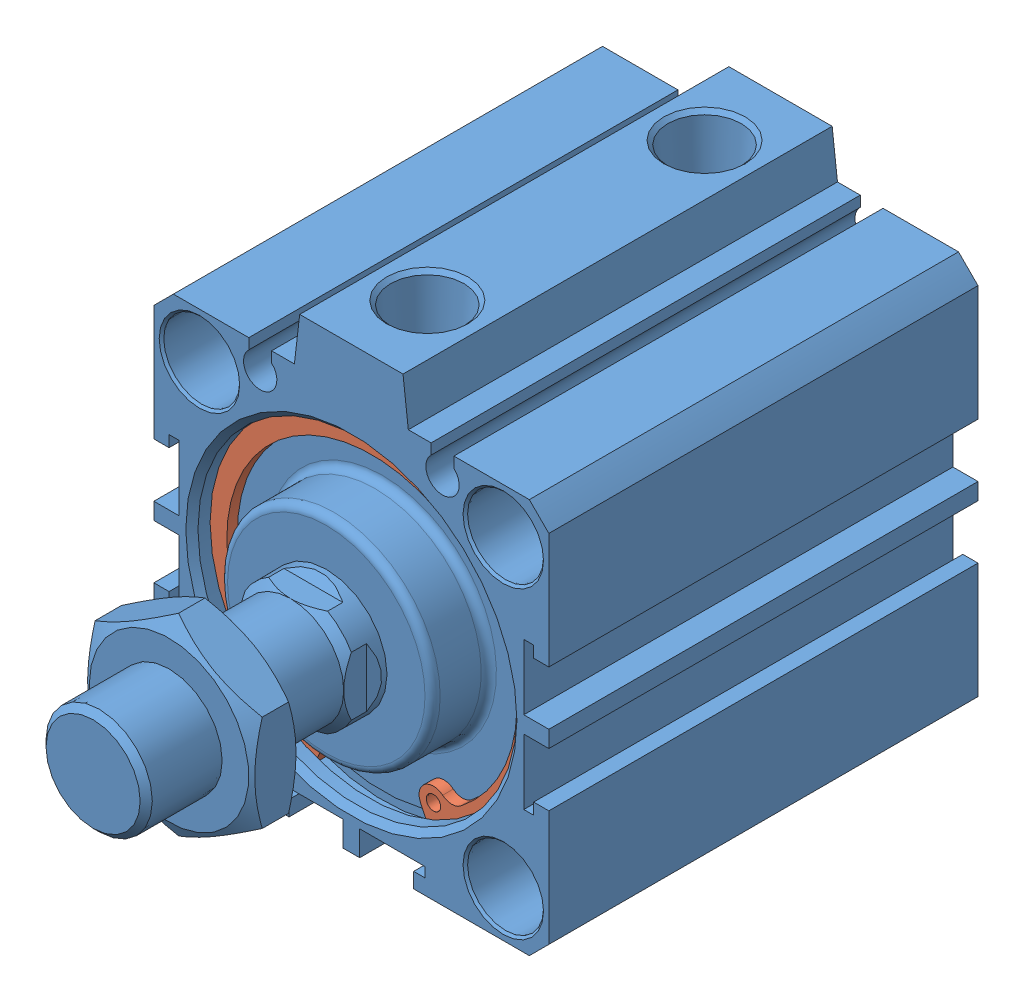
SolidWorks assembly JD40x20-BS.sldasm, configuration 默认 (file format 4400). Lengths in mm.
Overall size (52 58 90.5).
3 component instances, 2 part files, 0 mates.
Components (placement in the parent):
- JD040x20-BS-1: JD040x20-BS.sldprt [默认] at origin size (52 58 90.5)
- R _X2_5F6274B0_X0_ 42-1: R _X2_5F6274B0_X0_ 42.sldprt [默认] at (-1.555 21.0766 52.2) size (44.5 43.17 1.6)
- R _X2_5F6274B0_X0_ 42-2: R _X2_5F6274B0_X0_ 42.sldprt [默认] at (-1.555 21.0766 2.7) size (44.5 43.17 1.6)
